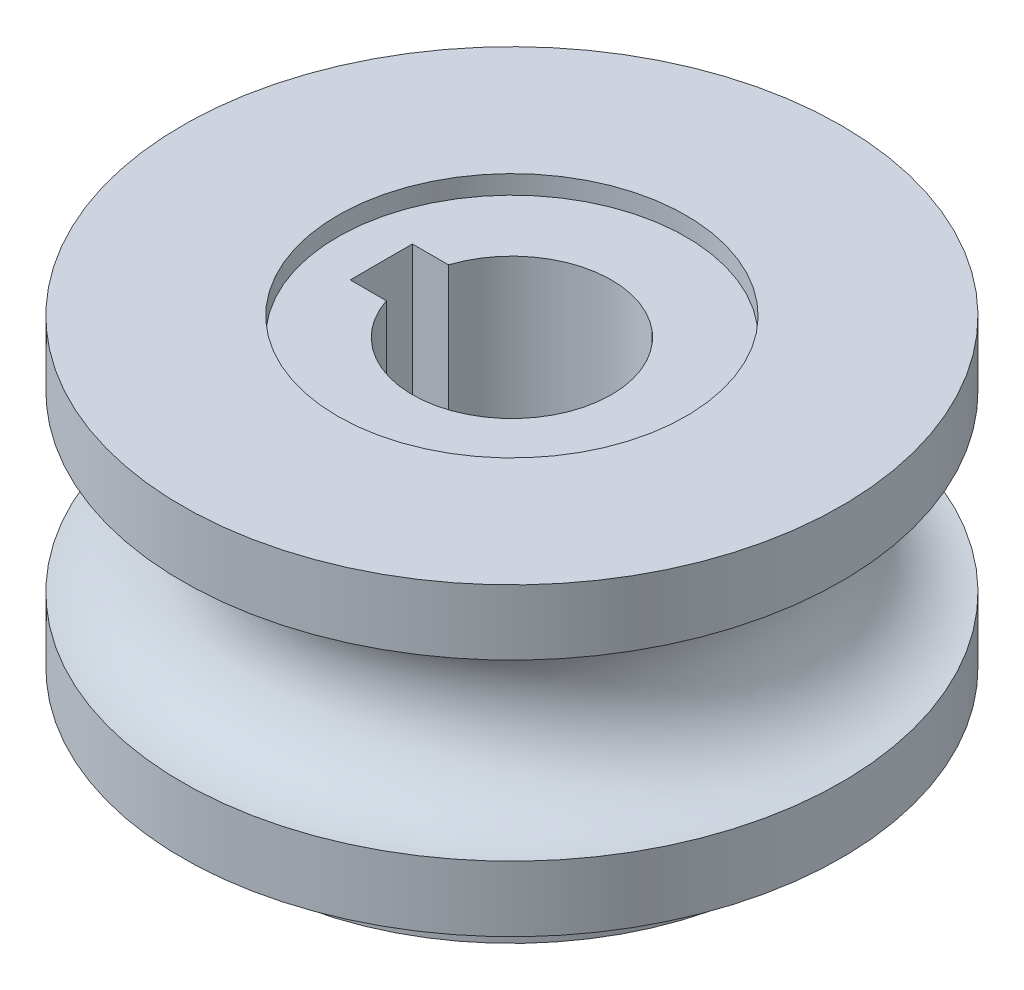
from build123d import *

# Parameters (mm, degrees)
ESQUISSE2_R             = 4.75
ENL_V_MAT_EXTRU_1_DEPTH = 0.75
ESQUISSE3_R             = 7
ENL_V_MAT_EXTRU_2_DEPTH = 0.75
ESQUISSE4_R             = 4
ENL_V_MAT_EXTRU_3_DEPTH = 24.390703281
ENL_V_MAT_EXTRU_4_DEPTH = 24.390703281


with BuildPart() as part:
    # Esquisse1 → Base-R_volution (revolve)
    with BuildSketch(Plane.XY, mode=Mode.PRIVATE) as base_r_volution_sk:
        with BuildLine():
            Line((0, 0), (6.5, 0))
            Line((6.5, 0), (6.5, 0.5))
            Line((6.5, 0.5), (10.75, 0.5))
            Line((10.75, 0.5), (10.75, 2.5))
            Line((10.75, 2.5), (13.25, 2.5))
            Line((13.25, 2.5), (13.25, 5.13))
            ThreePointArc((13.25, 5.13), (9.75, 8.63), (13.25, 12.13))
            Line((13.25, 12.13), (13.25, 14.75))
            Line((13.25, 14.75), (0, 14.75))
            Line((0, 14.75), (0, 0))
        make_face()
    revolve(base_r_volution_sk.sketch.rotate(Axis((0, 0, 0), (0, 1, 0)), 90), axis=Axis((0, 0, 0), (0, 1, 0)))

    # Esquisse2 → Enl_v. mat.-Extru.1 (cut)
    with BuildSketch(Plane.XZ):
        Circle(ESQUISSE2_R)
    extrude(amount=-ENL_V_MAT_EXTRU_1_DEPTH, mode=Mode.SUBTRACT)

    # Esquisse3 → Enl_v. mat.-Extru.2 (cut)
    with BuildSketch(Plane(origin=(0, 14.75, 0), x_dir=(-1, 0, 0), z_dir=(0, 1, 0))):
        with Locations(Location((0, 0, 0), (0, 0, 90))):
            Circle(ESQUISSE3_R)
    extrude(amount=-ENL_V_MAT_EXTRU_2_DEPTH, mode=Mode.SUBTRACT)

    # Esquisse4 → Enl_v. mat.-Extru.3 (cut, through all)
    with BuildSketch(Plane(origin=(0, 14, 0), x_dir=(-1, 0, 0), z_dir=(0, 1, 0))):
        Circle(ESQUISSE4_R)
    extrude(amount=-ENL_V_MAT_EXTRU_3_DEPTH, mode=Mode.SUBTRACT)

    # Esquisse5 → Enl_v. mat.-Extru.4 (cut, through all)
    with BuildSketch(Plane(origin=(0, 14, 0), x_dir=(-1, 0, 0), z_dir=(0, 1, 0))):
        with BuildLine():
            Line((5.25, -1.25), (3.799671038, -1.25))
            ThreePointArc((3.799671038, -1.25), (4, 0), (3.799671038, 1.25))
            Line((3.799671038, 1.25), (5.25, 1.25))
            Line((5.25, 1.25), (5.25, -1.25))
        make_face()
    extrude(amount=-ENL_V_MAT_EXTRU_4_DEPTH, mode=Mode.SUBTRACT)


solid = part.part
